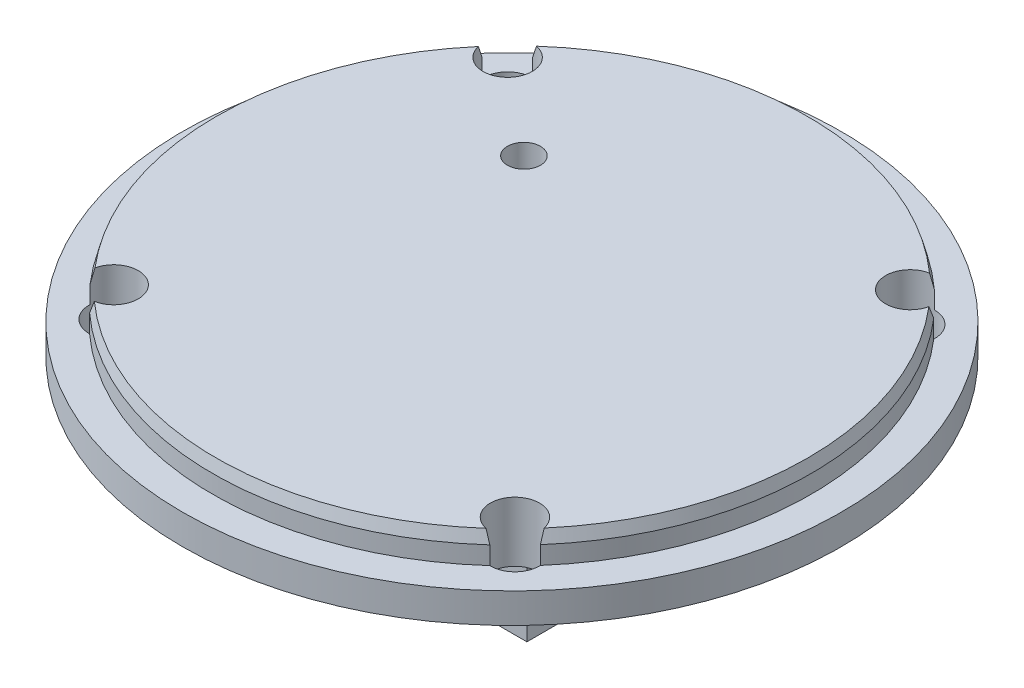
ISO-10303-21;
HEADER;
FILE_DESCRIPTION(('STEP AP214'),'2;1');
FILE_NAME('part.step','',(''),(''),'','','');
FILE_SCHEMA(('AUTOMOTIVE_DESIGN { 1 0 10303 214 1 1 1 1 }'));
ENDSEC;
DATA;
#1=APPLICATION_CONTEXT('core data for automotive mechanical design processes');
#2=APPLICATION_PROTOCOL_DEFINITION('international standard','automotive_design',2000,#1);
#3=PRODUCT_CONTEXT('',#1,'mechanical');
#4=PRODUCT('Part','Part','',(#3));
#5=PRODUCT_RELATED_PRODUCT_CATEGORY('part','',(#4));
#6=PRODUCT_DEFINITION_FORMATION('','',#4);
#7=PRODUCT_DEFINITION_CONTEXT('part definition',#1,'design');
#8=PRODUCT_DEFINITION('design','',#6,#7);
#9=PRODUCT_DEFINITION_SHAPE('','',#8);
#10=(LENGTH_UNIT() NAMED_UNIT(*) SI_UNIT(.MILLI.,.METRE.));
#11=(NAMED_UNIT(*) PLANE_ANGLE_UNIT() SI_UNIT($,.RADIAN.));
#12=(NAMED_UNIT(*) SI_UNIT($,.STERADIAN.) SOLID_ANGLE_UNIT());
#13=UNCERTAINTY_MEASURE_WITH_UNIT(LENGTH_MEASURE(1.E-05),#10,'distance_accuracy_value','');
#14=(GEOMETRIC_REPRESENTATION_CONTEXT(3) GLOBAL_UNCERTAINTY_ASSIGNED_CONTEXT((#13)) GLOBAL_UNIT_ASSIGNED_CONTEXT((#10,
#11,#12)) REPRESENTATION_CONTEXT('',''));
#15=CARTESIAN_POINT('',(0.,0.,0.));
#16=DIRECTION('',(0.,0.,1.));
#17=DIRECTION('',(1.,0.,0.));
#18=AXIS2_PLACEMENT_3D('',#15,#16,#17);
#19=CARTESIAN_POINT('',(0.,10.,0.));
#20=DIRECTION('',(0.,-1.,0.));
#21=DIRECTION('',(0.,0.,-1.));
#22=AXIS2_PLACEMENT_3D('',#19,#20,#21);
#23=CYLINDRICAL_SURFACE('',#22,49.9);
#24=DIRECTION('',(0.,-1.,0.));
#25=VECTOR('',#24,1.);
#26=CARTESIAN_POINT('',(-33.5127812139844,5.,-36.9716580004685));
#27=LINE('',#26,#25);
#28=CARTESIAN_POINT('',(-33.5127812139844,5.,-36.9716580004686));
#29=VERTEX_POINT('',#28);
#30=CARTESIAN_POINT('',(-33.5127812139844,7.99999999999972,-36.9716580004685));
#31=VERTEX_POINT('',#30);
#32=EDGE_CURVE('E236',#29,#31,#27,.F.);
#33=ORIENTED_EDGE('',*,*,#32,.T.);
#34=CARTESIAN_POINT('',(0.,7.99999999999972,0.));
#35=DIRECTION('',(0.,1.,0.));
#36=DIRECTION('',(0.,0.,1.));
#37=AXIS2_PLACEMENT_3D('',#34,#35,#36);
#38=CIRCLE('',#37,49.9);
#39=CARTESIAN_POINT('',(33.5133115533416,7.99999999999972,-36.971177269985));
#40=VERTEX_POINT('',#39);
#41=EDGE_CURVE('E433',#31,#40,#38,.F.);
#42=ORIENTED_EDGE('',*,*,#41,.T.);
#43=DIRECTION('',(0.,-1.,0.));
#44=VECTOR('',#43,1.);
#45=CARTESIAN_POINT('',(33.5133115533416,5.,-36.971177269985));
#46=LINE('',#45,#44);
#47=CARTESIAN_POINT('',(33.5133115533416,5.,-36.9711772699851));
#48=VERTEX_POINT('',#47);
#49=EDGE_CURVE('E242',#40,#48,#46,.T.);
#50=ORIENTED_EDGE('',*,*,#49,.T.);
#51=CARTESIAN_POINT('',(0.,5.,0.));
#52=DIRECTION('',(0.,1.,0.));
#53=DIRECTION('',(0.,0.,1.));
#54=AXIS2_PLACEMENT_3D('',#51,#52,#53);
#55=CIRCLE('',#54,49.9);
#56=EDGE_CURVE('E199',#48,#29,#55,.T.);
#57=ORIENTED_EDGE('',*,*,#56,.T.);
#58=EDGE_LOOP('',(#33,#42,#50,#57));
#59=FACE_BOUND('',#58,.T.);
#60=ADVANCED_FACE('F37',(#59),#23,.T.);
#61=DIRECTION('',(0.,-1.,0.));
#62=VECTOR('',#61,1.);
#63=CARTESIAN_POINT('',(-37.6882981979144,5.,32.7047730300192));
#64=LINE('',#63,#62);
#65=CARTESIAN_POINT('',(-37.6882981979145,5.,32.7047730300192));
#66=VERTEX_POINT('',#65);
#67=CARTESIAN_POINT('',(-37.6882981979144,8.00000000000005,32.7047730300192));
#68=VERTEX_POINT('',#67);
#69=EDGE_CURVE('E217',#66,#68,#64,.F.);
#70=ORIENTED_EDGE('',*,*,#69,.T.);
#71=CARTESIAN_POINT('',(0.,8.00000000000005,0.));
#72=DIRECTION('',(0.,1.,0.));
#73=DIRECTION('',(0.,0.,1.));
#74=AXIS2_PLACEMENT_3D('',#71,#72,#73);
#75=CIRCLE('',#74,49.9);
#76=CARTESIAN_POINT('',(-37.6882981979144,8.00000000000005,-32.7047730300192));
#77=VERTEX_POINT('',#76);
#78=EDGE_CURVE('E376',#68,#77,#75,.F.);
#79=ORIENTED_EDGE('',*,*,#78,.T.);
#80=DIRECTION('',(0.,-1.,0.));
#81=VECTOR('',#80,1.);
#82=CARTESIAN_POINT('',(-37.6882981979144,5.,-32.7047730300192));
#83=LINE('',#82,#81);
#84=CARTESIAN_POINT('',(-37.6882981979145,5.,-32.7047730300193));
#85=VERTEX_POINT('',#84);
#86=EDGE_CURVE('E220',#77,#85,#83,.T.);
#87=ORIENTED_EDGE('',*,*,#86,.T.);
#88=EDGE_CURVE('E200',#85,#66,#55,.T.);
#89=ORIENTED_EDGE('',*,*,#88,.T.);
#90=EDGE_LOOP('',(#70,#79,#87,#89));
#91=FACE_BOUND('',#90,.T.);
#92=ADVANCED_FACE('F216',(#91),#23,.T.);
#93=DIRECTION('',(0.,-1.,0.));
#94=VECTOR('',#93,1.);
#95=CARTESIAN_POINT('',(33.3904623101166,5.,37.0821658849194));
#96=LINE('',#95,#94);
#97=CARTESIAN_POINT('',(33.3904623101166,5.,37.0821658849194));
#98=VERTEX_POINT('',#97);
#99=CARTESIAN_POINT('',(33.3904623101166,8.00000000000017,37.0821658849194));
#100=VERTEX_POINT('',#99);
#101=EDGE_CURVE('E184',#98,#100,#96,.F.);
#102=ORIENTED_EDGE('',*,*,#101,.T.);
#103=CARTESIAN_POINT('',(0.,8.00000000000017,0.));
#104=DIRECTION('',(0.,1.,0.));
#105=DIRECTION('',(0.,0.,1.));
#106=AXIS2_PLACEMENT_3D('',#103,#104,#105);
#107=CIRCLE('',#106,49.9);
#108=CARTESIAN_POINT('',(-33.5127812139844,8.00000000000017,36.9716580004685));
#109=VERTEX_POINT('',#108);
#110=EDGE_CURVE('E11',#100,#109,#107,.F.);
#111=ORIENTED_EDGE('',*,*,#110,.T.);
#112=DIRECTION('',(0.,-1.,0.));
#113=VECTOR('',#112,1.);
#114=CARTESIAN_POINT('',(-33.5127812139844,5.,36.9716580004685));
#115=LINE('',#114,#113);
#116=CARTESIAN_POINT('',(-33.5127812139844,5.,36.9716580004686));
#117=VERTEX_POINT('',#116);
#118=EDGE_CURVE('E228',#109,#117,#115,.T.);
#119=ORIENTED_EDGE('',*,*,#118,.T.);
#120=EDGE_CURVE('E196',#117,#98,#55,.T.);
#121=ORIENTED_EDGE('',*,*,#120,.T.);
#122=EDGE_LOOP('',(#102,#111,#119,#121));
#123=FACE_BOUND('',#122,.T.);
#124=ADVANCED_FACE('F346',(#123),#23,.T.);
#125=CARTESIAN_POINT('',(0.,0.,0.));
#126=DIRECTION('',(0.,1.,0.));
#127=DIRECTION('',(0.,0.,1.));
#128=AXIS2_PLACEMENT_3D('',#125,#126,#127);
#129=PLANE('',#128);
#130=CARTESIAN_POINT('',(-17.9998565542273,0.,-19.9999999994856));
#131=DIRECTION('',(0.,1.,0.));
#132=DIRECTION('',(0.,0.,1.));
#133=AXIS2_PLACEMENT_3D('',#130,#131,#132);
#134=CIRCLE('',#133,2.75);
#135=CARTESIAN_POINT('',(-17.9998565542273,0.,-17.2499999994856));
#136=VERTEX_POINT('',#135);
#137=EDGE_CURVE('E493',#136,#136,#134,.T.);
#138=ORIENTED_EDGE('',*,*,#137,.T.);
#139=EDGE_LOOP('',(#138));
#140=FACE_BOUND('',#139,.T.);
#141=CARTESIAN_POINT('',(-33.5917270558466,0.,-32.8724181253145));
#142=DIRECTION('',(0.,-1.,0.));
#143=DIRECTION('',(0.,0.,-1.));
#144=AXIS2_PLACEMENT_3D('',#141,#142,#143);
#145=CIRCLE('',#144,4.1);
#146=CARTESIAN_POINT('',(-33.5917270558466,0.,-36.9724181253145));
#147=VERTEX_POINT('',#146);
#148=EDGE_CURVE('E487',#147,#147,#145,.T.);
#149=ORIENTED_EDGE('',*,*,#148,.F.);
#150=EDGE_LOOP('',(#149));
#151=FACE_BOUND('',#150,.T.);
#152=CARTESIAN_POINT('',(-33.5917270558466,0.,32.8724181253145));
#153=DIRECTION('',(0.,-1.,0.));
#154=DIRECTION('',(0.,0.,-1.));
#155=AXIS2_PLACEMENT_3D('',#152,#153,#154);
#156=CIRCLE('',#155,4.1);
#157=CARTESIAN_POINT('',(-33.5917270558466,0.,28.7724181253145));
#158=VERTEX_POINT('',#157);
#159=EDGE_CURVE('E490',#158,#158,#156,.T.);
#160=ORIENTED_EDGE('',*,*,#159,.F.);
#161=EDGE_LOOP('',(#160));
#162=FACE_BOUND('',#161,.T.);
#163=CARTESIAN_POINT('',(33.4832151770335,0.,32.9832151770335));
#164=DIRECTION('',(0.,-1.,0.));
#165=DIRECTION('',(0.,0.,-1.));
#166=AXIS2_PLACEMENT_3D('',#163,#164,#165);
#167=CIRCLE('',#166,4.1);
#168=CARTESIAN_POINT('',(33.4832151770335,0.,28.8832151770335));
#169=VERTEX_POINT('',#168);
#170=EDGE_CURVE('E498',#169,#169,#167,.T.);
#171=ORIENTED_EDGE('',*,*,#170,.F.);
#172=EDGE_LOOP('',(#171));
#173=FACE_BOUND('',#172,.T.);
#174=CARTESIAN_POINT('',(33.5921985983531,0.,-32.8719362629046));
#175=DIRECTION('',(0.,-1.,0.));
#176=DIRECTION('',(0.,0.,-1.));
#177=AXIS2_PLACEMENT_3D('',#174,#175,#176);
#178=CIRCLE('',#177,4.1);
#179=CARTESIAN_POINT('',(33.5921985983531,0.,-36.9719362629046));
#180=VERTEX_POINT('',#179);
#181=EDGE_CURVE('E238',#180,#180,#178,.T.);
#182=ORIENTED_EDGE('',*,*,#181,.F.);
#183=EDGE_LOOP('',(#182));
#184=FACE_BOUND('',#183,.T.);
#185=CARTESIAN_POINT('',(0.,0.,0.));
#186=DIRECTION('',(0.,1.,0.));
#187=DIRECTION('',(0.,0.,1.));
#188=AXIS2_PLACEMENT_3D('',#185,#186,#187);
#189=CIRCLE('',#188,55.);
#190=CARTESIAN_POINT('',(0.,0.,55.));
#191=VERTEX_POINT('',#190);
#192=EDGE_CURVE('E206',#191,#191,#189,.T.);
#193=ORIENTED_EDGE('',*,*,#192,.F.);
#194=EDGE_LOOP('',(#193));
#195=FACE_BOUND('',#194,.T.);
#196=DIRECTION('',(0.,0.,-1.));
#197=VECTOR('',#196,1.);
#198=CARTESIAN_POINT('',(-17.5,0.,-15.));
#199=LINE('',#198,#197);
#200=CARTESIAN_POINT('',(-17.5,0.,15.));
#201=VERTEX_POINT('',#200);
#202=CARTESIAN_POINT('',(-17.5,0.,-15.));
#203=VERTEX_POINT('',#202);
#204=EDGE_CURVE('E281',#201,#203,#199,.T.);
#205=ORIENTED_EDGE('',*,*,#204,.F.);
#206=DIRECTION('',(-1.,0.,0.));
#207=VECTOR('',#206,1.);
#208=CARTESIAN_POINT('',(17.5,0.,15.));
#209=LINE('',#208,#207);
#210=CARTESIAN_POINT('',(17.5,0.,15.));
#211=VERTEX_POINT('',#210);
#212=EDGE_CURVE('E286',#211,#201,#209,.T.);
#213=ORIENTED_EDGE('',*,*,#212,.F.);
#214=DIRECTION('',(0.,0.,1.));
#215=VECTOR('',#214,1.);
#216=CARTESIAN_POINT('',(17.5,0.,-15.));
#217=LINE('',#216,#215);
#218=CARTESIAN_POINT('',(17.5,0.,-15.));
#219=VERTEX_POINT('',#218);
#220=EDGE_CURVE('E298',#219,#211,#217,.T.);
#221=ORIENTED_EDGE('',*,*,#220,.F.);
#222=DIRECTION('',(1.,0.,0.));
#223=VECTOR('',#222,1.);
#224=CARTESIAN_POINT('',(17.5,0.,-15.));
#225=LINE('',#224,#223);
#226=EDGE_CURVE('E295',#203,#219,#225,.T.);
#227=ORIENTED_EDGE('',*,*,#226,.F.);
#228=EDGE_LOOP('',(#205,#213,#221,#227));
#229=FACE_BOUND('',#228,.T.);
#230=ADVANCED_FACE('F318',(#140,#151,#162,#173,#184,#195,#229),#129,.F.);
#231=CARTESIAN_POINT('',(0.,5.,0.));
#232=DIRECTION('',(0.,-1.,0.));
#233=DIRECTION('',(0.,0.,-1.));
#234=AXIS2_PLACEMENT_3D('',#231,#232,#233);
#235=CYLINDRICAL_SURFACE('',#234,55.);
#236=CARTESIAN_POINT('',(0.,5.,0.));
#237=DIRECTION('',(0.,1.,0.));
#238=DIRECTION('',(0.,0.,1.));
#239=AXIS2_PLACEMENT_3D('',#236,#237,#238);
#240=CIRCLE('',#239,55.);
#241=CARTESIAN_POINT('',(0.,5.,55.));
#242=VERTEX_POINT('',#241);
#243=EDGE_CURVE('E210',#242,#242,#240,.T.);
#244=ORIENTED_EDGE('',*,*,#243,.F.);
#245=EDGE_LOOP('',(#244));
#246=FACE_BOUND('',#245,.T.);
#247=ORIENTED_EDGE('',*,*,#192,.T.);
#248=EDGE_LOOP('',(#247));
#249=FACE_BOUND('',#248,.T.);
#250=ADVANCED_FACE('F357',(#246,#249),#235,.T.);
#251=CARTESIAN_POINT('',(0.,5.,0.));
#252=DIRECTION('',(0.,1.,0.));
#253=DIRECTION('',(0.,0.,1.));
#254=AXIS2_PLACEMENT_3D('',#251,#252,#253);
#255=PLANE('',#254);
#256=CARTESIAN_POINT('',(-33.5917270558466,5.,-32.8724181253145));
#257=DIRECTION('',(0.,1.,0.));
#258=DIRECTION('',(0.,0.,1.));
#259=AXIS2_PLACEMENT_3D('',#256,#257,#258);
#260=CIRCLE('',#259,4.1);
#261=EDGE_CURVE('E223',#29,#85,#260,.T.);
#262=ORIENTED_EDGE('',*,*,#261,.F.);
#263=ORIENTED_EDGE('',*,*,#56,.F.);
#264=CARTESIAN_POINT('',(33.5921985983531,5.,-32.8719362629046));
#265=DIRECTION('',(0.,1.,0.));
#266=DIRECTION('',(0.,0.,1.));
#267=AXIS2_PLACEMENT_3D('',#264,#265,#266);
#268=CIRCLE('',#267,4.1);
#269=CARTESIAN_POINT('',(37.6887673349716,5.,-32.7042323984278));
#270=VERTEX_POINT('',#269);
#271=EDGE_CURVE('E195',#270,#48,#268,.T.);
#272=ORIENTED_EDGE('',*,*,#271,.F.);
#273=CARTESIAN_POINT('',(37.5803065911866,5.,32.8288068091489));
#274=VERTEX_POINT('',#273);
#275=EDGE_CURVE('E176',#274,#270,#55,.T.);
#276=ORIENTED_EDGE('',*,*,#275,.F.);
#277=CARTESIAN_POINT('',(33.4832151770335,5.,32.9832151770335));
#278=DIRECTION('',(0.,1.,0.));
#279=DIRECTION('',(0.,0.,1.));
#280=AXIS2_PLACEMENT_3D('',#277,#278,#279);
#281=CIRCLE('',#280,4.1);
#282=EDGE_CURVE('E179',#98,#274,#281,.T.);
#283=ORIENTED_EDGE('',*,*,#282,.F.);
#284=ORIENTED_EDGE('',*,*,#120,.F.);
#285=CARTESIAN_POINT('',(-33.5917270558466,5.,32.8724181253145));
#286=DIRECTION('',(0.,1.,0.));
#287=DIRECTION('',(0.,0.,1.));
#288=AXIS2_PLACEMENT_3D('',#285,#286,#287);
#289=CIRCLE('',#288,4.1);
#290=EDGE_CURVE('E225',#66,#117,#289,.T.);
#291=ORIENTED_EDGE('',*,*,#290,.F.);
#292=ORIENTED_EDGE('',*,*,#88,.F.);
#293=EDGE_LOOP('',(#262,#263,#272,#276,#283,#284,#291,#292));
#294=FACE_BOUND('',#293,.T.);
#295=ORIENTED_EDGE('',*,*,#243,.T.);
#296=EDGE_LOOP('',(#295));
#297=FACE_BOUND('',#296,.T.);
#298=ADVANCED_FACE('F191',(#294,#297),#255,.T.);
#299=DIRECTION('',(0.,-1.,0.));
#300=VECTOR('',#299,1.);
#301=CARTESIAN_POINT('',(37.6887673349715,5.,-32.7042323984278));
#302=LINE('',#301,#300);
#303=CARTESIAN_POINT('',(37.6887673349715,7.9999999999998,-32.7042323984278));
#304=VERTEX_POINT('',#303);
#305=EDGE_CURVE('E247',#270,#304,#302,.F.);
#306=ORIENTED_EDGE('',*,*,#305,.T.);
#307=CARTESIAN_POINT('',(0.,7.9999999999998,0.));
#308=DIRECTION('',(0.,1.,0.));
#309=DIRECTION('',(0.,0.,1.));
#310=AXIS2_PLACEMENT_3D('',#307,#308,#309);
#311=CIRCLE('',#310,49.9);
#312=CARTESIAN_POINT('',(37.5803065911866,7.9999999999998,32.8288068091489));
#313=VERTEX_POINT('',#312);
#314=EDGE_CURVE('E61',#304,#313,#311,.F.);
#315=ORIENTED_EDGE('',*,*,#314,.T.);
#316=DIRECTION('',(0.,-1.,0.));
#317=VECTOR('',#316,1.);
#318=CARTESIAN_POINT('',(37.5803065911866,5.,32.8288068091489));
#319=LINE('',#318,#317);
#320=EDGE_CURVE('E172',#313,#274,#319,.T.);
#321=ORIENTED_EDGE('',*,*,#320,.T.);
#322=ORIENTED_EDGE('',*,*,#275,.T.);
#323=EDGE_LOOP('',(#306,#315,#321,#322));
#324=FACE_BOUND('',#323,.T.);
#325=ADVANCED_FACE('F174',(#324),#23,.T.);
#326=CARTESIAN_POINT('',(0.,10.,0.));
#327=DIRECTION('',(0.,1.,0.));
#328=DIRECTION('',(0.,0.,1.));
#329=AXIS2_PLACEMENT_3D('',#326,#327,#328);
#330=PLANE('',#329);
#331=CARTESIAN_POINT('',(-17.9998565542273,10.,-19.9999999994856));
#332=DIRECTION('',(0.,1.,0.));
#333=DIRECTION('',(0.,0.,1.));
#334=AXIS2_PLACEMENT_3D('',#331,#332,#333);
#335=CIRCLE('',#334,2.75);
#336=CARTESIAN_POINT('',(-17.9998565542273,10.,-17.2499999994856));
#337=VERTEX_POINT('',#336);
#338=EDGE_CURVE('E502',#337,#337,#335,.T.);
#339=ORIENTED_EDGE('',*,*,#338,.F.);
#340=EDGE_LOOP('',(#339));
#341=FACE_BOUND('',#340,.T.);
#342=CARTESIAN_POINT('',(-33.5917270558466,10.,-32.8724181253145));
#343=DIRECTION('',(0.,-1.,0.));
#344=DIRECTION('',(0.,0.,-1.));
#345=AXIS2_PLACEMENT_3D('',#342,#343,#344);
#346=CIRCLE('',#345,4.1);
#347=CARTESIAN_POINT('',(-32.7964459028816,10.,-36.8945478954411));
#348=VERTEX_POINT('',#347);
#349=CARTESIAN_POINT('',(-37.5957028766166,10.,-31.9902743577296));
#350=VERTEX_POINT('',#349);
#351=EDGE_CURVE('E180',#348,#350,#346,.T.);
#352=ORIENTED_EDGE('',*,*,#351,.T.);
#353=CARTESIAN_POINT('',(0.,10.,0.));
#354=DIRECTION('',(0.,1.,0.));
#355=DIRECTION('',(0.,0.,1.));
#356=AXIS2_PLACEMENT_3D('',#353,#354,#355);
#357=CIRCLE('',#356,49.3641016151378);
#358=CARTESIAN_POINT('',(-37.5957028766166,10.,31.9902743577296));
#359=VERTEX_POINT('',#358);
#360=EDGE_CURVE('E374',#350,#359,#357,.T.);
#361=ORIENTED_EDGE('',*,*,#360,.T.);
#362=CARTESIAN_POINT('',(-33.5917270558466,10.,32.8724181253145));
#363=DIRECTION('',(0.,1.,0.));
#364=DIRECTION('',(0.,0.,1.));
#365=AXIS2_PLACEMENT_3D('',#362,#363,#364);
#366=CIRCLE('',#365,4.1);
#367=CARTESIAN_POINT('',(-32.7964459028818,10.,36.8945478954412));
#368=VERTEX_POINT('',#367);
#369=EDGE_CURVE('E457',#368,#359,#366,.T.);
#370=ORIENTED_EDGE('',*,*,#369,.F.);
#371=CARTESIAN_POINT('',(0.,10.,0.));
#372=DIRECTION('',(0.,1.,0.));
#373=DIRECTION('',(0.,0.,1.));
#374=AXIS2_PLACEMENT_3D('',#371,#372,#373);
#375=CIRCLE('',#374,49.3641016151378);
#376=CARTESIAN_POINT('',(32.6744293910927,10.,37.0026511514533));
#377=VERTEX_POINT('',#376);
#378=EDGE_CURVE('E370',#368,#377,#375,.T.);
#379=ORIENTED_EDGE('',*,*,#378,.T.);
#380=CARTESIAN_POINT('',(33.4832151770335,10.,32.9832151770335));
#381=DIRECTION('',(0.,1.,0.));
#382=DIRECTION('',(0.,0.,1.));
#383=AXIS2_PLACEMENT_3D('',#380,#381,#382);
#384=CIRCLE('',#383,4.1);
#385=CARTESIAN_POINT('',(37.4900286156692,10.,32.1140511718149));
#386=VERTEX_POINT('',#385);
#387=EDGE_CURVE('E459',#386,#377,#384,.T.);
#388=ORIENTED_EDGE('',*,*,#387,.F.);
#389=CARTESIAN_POINT('',(0.,10.,0.));
#390=DIRECTION('',(0.,1.,0.));
#391=DIRECTION('',(0.,0.,1.));
#392=AXIS2_PLACEMENT_3D('',#389,#390,#391);
#393=CIRCLE('',#392,49.3641016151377);
#394=CARTESIAN_POINT('',(37.5961617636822,10.,-31.9897350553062));
#395=VERTEX_POINT('',#394);
#396=EDGE_CURVE('E452',#386,#395,#393,.T.);
#397=ORIENTED_EDGE('',*,*,#396,.T.);
#398=CARTESIAN_POINT('',(33.5921985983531,10.,-32.8719362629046));
#399=DIRECTION('',(0.,-1.,0.));
#400=DIRECTION('',(0.,0.,-1.));
#401=AXIS2_PLACEMENT_3D('',#398,#399,#400);
#402=CIRCLE('',#401,4.1);
#403=CARTESIAN_POINT('',(32.7969751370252,10.,-36.8940774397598));
#404=VERTEX_POINT('',#403);
#405=EDGE_CURVE('E239',#395,#404,#402,.T.);
#406=ORIENTED_EDGE('',*,*,#405,.T.);
#407=CARTESIAN_POINT('',(0.,10.,0.));
#408=DIRECTION('',(0.,1.,0.));
#409=DIRECTION('',(0.,0.,1.));
#410=AXIS2_PLACEMENT_3D('',#407,#408,#409);
#411=CIRCLE('',#410,49.3641016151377);
#412=EDGE_CURVE('E379',#404,#348,#411,.T.);
#413=ORIENTED_EDGE('',*,*,#412,.T.);
#414=EDGE_LOOP('',(#352,#361,#370,#379,#388,#397,#406,#413));
#415=FACE_BOUND('',#414,.T.);
#416=ADVANCED_FACE('F350',(#341,#415),#330,.T.);
#417=CARTESIAN_POINT('',(-17.5,-25.,-15.));
#418=DIRECTION('',(1.,0.,0.));
#419=DIRECTION('',(0.,0.,-1.));
#420=AXIS2_PLACEMENT_3D('',#417,#418,#419);
#421=PLANE('',#420);
#422=ORIENTED_EDGE('',*,*,#204,.T.);
#423=DIRECTION('',(0.,1.,0.));
#424=VECTOR('',#423,1.);
#425=CARTESIAN_POINT('',(-17.5,-25.,-15.));
#426=LINE('',#425,#424);
#427=CARTESIAN_POINT('',(-17.5,-25.,-15.));
#428=VERTEX_POINT('',#427);
#429=EDGE_CURVE('E197',#428,#203,#426,.T.);
#430=ORIENTED_EDGE('',*,*,#429,.F.);
#431=DIRECTION('',(0.,0.,-1.));
#432=VECTOR('',#431,1.);
#433=CARTESIAN_POINT('',(-17.5,-25.,-15.));
#434=LINE('',#433,#432);
#435=CARTESIAN_POINT('',(-17.5,-25.,15.));
#436=VERTEX_POINT('',#435);
#437=EDGE_CURVE('E282',#436,#428,#434,.T.);
#438=ORIENTED_EDGE('',*,*,#437,.F.);
#439=DIRECTION('',(0.,1.,0.));
#440=VECTOR('',#439,1.);
#441=CARTESIAN_POINT('',(-17.5,-25.,15.));
#442=LINE('',#441,#440);
#443=EDGE_CURVE('E292',#436,#201,#442,.T.);
#444=ORIENTED_EDGE('',*,*,#443,.T.);
#445=EDGE_LOOP('',(#422,#430,#438,#444));
#446=FACE_BOUND('',#445,.T.);
#447=ADVANCED_FACE('F325',(#446),#421,.F.);
#448=CARTESIAN_POINT('',(17.5,-25.,-15.));
#449=DIRECTION('',(0.,0.,1.));
#450=DIRECTION('',(1.,0.,0.));
#451=AXIS2_PLACEMENT_3D('',#448,#449,#450);
#452=PLANE('',#451);
#453=DIRECTION('',(-1.,0.,0.));
#454=VECTOR('',#453,1.);
#455=CARTESIAN_POINT('',(17.5,-7.35,-15.));
#456=LINE('',#455,#454);
#457=CARTESIAN_POINT('',(10.1,-7.35,-15.));
#458=VERTEX_POINT('',#457);
#459=CARTESIAN_POINT('',(-10.1,-7.35,-15.));
#460=VERTEX_POINT('',#459);
#461=EDGE_CURVE('E275',#458,#460,#456,.T.);
#462=ORIENTED_EDGE('',*,*,#461,.T.);
#463=DIRECTION('',(0.,-1.,0.));
#464=VECTOR('',#463,1.);
#465=CARTESIAN_POINT('',(-10.1,-25.,-15.));
#466=LINE('',#465,#464);
#467=CARTESIAN_POINT('',(-10.1,-17.65,-15.));
#468=VERTEX_POINT('',#467);
#469=EDGE_CURVE('E278',#460,#468,#466,.T.);
#470=ORIENTED_EDGE('',*,*,#469,.T.);
#471=DIRECTION('',(1.,0.,0.));
#472=VECTOR('',#471,1.);
#473=CARTESIAN_POINT('',(17.5,-17.65,-15.));
#474=LINE('',#473,#472);
#475=CARTESIAN_POINT('',(10.1,-17.65,-15.));
#476=VERTEX_POINT('',#475);
#477=EDGE_CURVE('E263',#468,#476,#474,.T.);
#478=ORIENTED_EDGE('',*,*,#477,.T.);
#479=DIRECTION('',(0.,1.,0.));
#480=VECTOR('',#479,1.);
#481=CARTESIAN_POINT('',(10.1,-25.,-15.));
#482=LINE('',#481,#480);
#483=EDGE_CURVE('E272',#476,#458,#482,.T.);
#484=ORIENTED_EDGE('',*,*,#483,.T.);
#485=EDGE_LOOP('',(#462,#470,#478,#484));
#486=FACE_BOUND('',#485,.T.);
#487=ORIENTED_EDGE('',*,*,#226,.T.);
#488=DIRECTION('',(0.,1.,0.));
#489=VECTOR('',#488,1.);
#490=CARTESIAN_POINT('',(17.5,-25.,-15.));
#491=LINE('',#490,#489);
#492=CARTESIAN_POINT('',(17.5,-25.,-15.));
#493=VERTEX_POINT('',#492);
#494=EDGE_CURVE('E202',#493,#219,#491,.T.);
#495=ORIENTED_EDGE('',*,*,#494,.F.);
#496=DIRECTION('',(1.,0.,0.));
#497=VECTOR('',#496,1.);
#498=CARTESIAN_POINT('',(17.5,-25.,-15.));
#499=LINE('',#498,#497);
#500=EDGE_CURVE('E285',#428,#493,#499,.T.);
#501=ORIENTED_EDGE('',*,*,#500,.F.);
#502=ORIENTED_EDGE('',*,*,#429,.T.);
#503=EDGE_LOOP('',(#487,#495,#501,#502));
#504=FACE_BOUND('',#503,.T.);
#505=ADVANCED_FACE('F315',(#486,#504),#452,.F.);
#506=CARTESIAN_POINT('',(17.5,-25.,-15.));
#507=DIRECTION('',(-1.,0.,0.));
#508=DIRECTION('',(0.,0.,1.));
#509=AXIS2_PLACEMENT_3D('',#506,#507,#508);
#510=PLANE('',#509);
#511=ORIENTED_EDGE('',*,*,#220,.T.);
#512=DIRECTION('',(0.,1.,0.));
#513=VECTOR('',#512,1.);
#514=CARTESIAN_POINT('',(17.5,-25.,15.));
#515=LINE('',#514,#513);
#516=CARTESIAN_POINT('',(17.5,-25.,15.));
#517=VERTEX_POINT('',#516);
#518=EDGE_CURVE('E305',#517,#211,#515,.T.);
#519=ORIENTED_EDGE('',*,*,#518,.F.);
#520=DIRECTION('',(0.,0.,1.));
#521=VECTOR('',#520,1.);
#522=CARTESIAN_POINT('',(17.5,-25.,-15.));
#523=LINE('',#522,#521);
#524=EDGE_CURVE('E288',#493,#517,#523,.T.);
#525=ORIENTED_EDGE('',*,*,#524,.F.);
#526=ORIENTED_EDGE('',*,*,#494,.T.);
#527=EDGE_LOOP('',(#511,#519,#525,#526));
#528=FACE_BOUND('',#527,.T.);
#529=ADVANCED_FACE('F312',(#528),#510,.F.);
#530=CARTESIAN_POINT('',(17.5,-25.,15.));
#531=DIRECTION('',(0.,0.,-1.));
#532=DIRECTION('',(-1.,0.,0.));
#533=AXIS2_PLACEMENT_3D('',#530,#531,#532);
#534=PLANE('',#533);
#535=DIRECTION('',(1.,0.,0.));
#536=VECTOR('',#535,1.);
#537=CARTESIAN_POINT('',(10.1,-17.65,15.));
#538=LINE('',#537,#536);
#539=CARTESIAN_POINT('',(-10.1,-17.65,15.));
#540=VERTEX_POINT('',#539);
#541=CARTESIAN_POINT('',(10.1,-17.65,15.));
#542=VERTEX_POINT('',#541);
#543=EDGE_CURVE('E251',#540,#542,#538,.T.);
#544=ORIENTED_EDGE('',*,*,#543,.F.);
#545=DIRECTION('',(0.,-1.,0.));
#546=VECTOR('',#545,1.);
#547=CARTESIAN_POINT('',(-10.1,-17.65,15.));
#548=LINE('',#547,#546);
#549=CARTESIAN_POINT('',(-10.1,-7.35,15.));
#550=VERTEX_POINT('',#549);
#551=EDGE_CURVE('E249',#550,#540,#548,.T.);
#552=ORIENTED_EDGE('',*,*,#551,.F.);
#553=DIRECTION('',(-1.,0.,0.));
#554=VECTOR('',#553,1.);
#555=CARTESIAN_POINT('',(10.1,-7.35,15.));
#556=LINE('',#555,#554);
#557=CARTESIAN_POINT('',(10.1,-7.35,15.));
#558=VERTEX_POINT('',#557);
#559=EDGE_CURVE('E257',#558,#550,#556,.T.);
#560=ORIENTED_EDGE('',*,*,#559,.F.);
#561=DIRECTION('',(0.,1.,0.));
#562=VECTOR('',#561,1.);
#563=CARTESIAN_POINT('',(10.1,-17.65,15.));
#564=LINE('',#563,#562);
#565=EDGE_CURVE('E254',#542,#558,#564,.T.);
#566=ORIENTED_EDGE('',*,*,#565,.F.);
#567=EDGE_LOOP('',(#544,#552,#560,#566));
#568=FACE_BOUND('',#567,.T.);
#569=ORIENTED_EDGE('',*,*,#212,.T.);
#570=ORIENTED_EDGE('',*,*,#443,.F.);
#571=DIRECTION('',(-1.,0.,0.));
#572=VECTOR('',#571,1.);
#573=CARTESIAN_POINT('',(17.5,-25.,15.));
#574=LINE('',#573,#572);
#575=EDGE_CURVE('E290',#517,#436,#574,.T.);
#576=ORIENTED_EDGE('',*,*,#575,.F.);
#577=ORIENTED_EDGE('',*,*,#518,.T.);
#578=EDGE_LOOP('',(#569,#570,#576,#577));
#579=FACE_BOUND('',#578,.T.);
#580=ADVANCED_FACE('F321',(#568,#579),#534,.F.);
#581=CARTESIAN_POINT('',(0.,-25.,0.));
#582=DIRECTION('',(0.,-1.,0.));
#583=DIRECTION('',(0.,0.,-1.));
#584=AXIS2_PLACEMENT_3D('',#581,#582,#583);
#585=PLANE('',#584);
#586=ORIENTED_EDGE('',*,*,#437,.T.);
#587=ORIENTED_EDGE('',*,*,#500,.T.);
#588=ORIENTED_EDGE('',*,*,#524,.T.);
#589=ORIENTED_EDGE('',*,*,#575,.T.);
#590=EDGE_LOOP('',(#586,#587,#588,#589));
#591=FACE_BOUND('',#590,.T.);
#592=ADVANCED_FACE('F327',(#591),#585,.T.);
#593=CARTESIAN_POINT('',(-10.1,-17.65,-55.));
#594=DIRECTION('',(-1.,0.,0.));
#595=DIRECTION('',(0.,0.,1.));
#596=AXIS2_PLACEMENT_3D('',#593,#594,#595);
#597=PLANE('',#596);
#598=DIRECTION('',(0.,0.,1.));
#599=VECTOR('',#598,1.);
#600=CARTESIAN_POINT('',(-10.1,-7.35,-55.));
#601=LINE('',#600,#599);
#602=EDGE_CURVE('E261',#460,#550,#601,.T.);
#603=ORIENTED_EDGE('',*,*,#602,.T.);
#604=ORIENTED_EDGE('',*,*,#551,.T.);
#605=DIRECTION('',(0.,0.,1.));
#606=VECTOR('',#605,1.);
#607=CARTESIAN_POINT('',(-10.1,-17.65,-55.));
#608=LINE('',#607,#606);
#609=EDGE_CURVE('E260',#468,#540,#608,.T.);
#610=ORIENTED_EDGE('',*,*,#609,.F.);
#611=ORIENTED_EDGE('',*,*,#469,.F.);
#612=EDGE_LOOP('',(#603,#604,#610,#611));
#613=FACE_BOUND('',#612,.T.);
#614=ADVANCED_FACE('F329',(#613),#597,.F.);
#615=CARTESIAN_POINT('',(10.1,-7.35,-55.));
#616=DIRECTION('',(0.,1.,0.));
#617=DIRECTION('',(-1.,0.,0.));
#618=AXIS2_PLACEMENT_3D('',#615,#616,#617);
#619=PLANE('',#618);
#620=DIRECTION('',(0.,0.,1.));
#621=VECTOR('',#620,1.);
#622=CARTESIAN_POINT('',(10.1,-7.35,-55.));
#623=LINE('',#622,#621);
#624=EDGE_CURVE('E264',#458,#558,#623,.T.);
#625=ORIENTED_EDGE('',*,*,#624,.T.);
#626=ORIENTED_EDGE('',*,*,#559,.T.);
#627=ORIENTED_EDGE('',*,*,#602,.F.);
#628=ORIENTED_EDGE('',*,*,#461,.F.);
#629=EDGE_LOOP('',(#625,#626,#627,#628));
#630=FACE_BOUND('',#629,.T.);
#631=ADVANCED_FACE('F335',(#630),#619,.F.);
#632=CARTESIAN_POINT('',(10.1,-17.65,-55.));
#633=DIRECTION('',(1.,0.,0.));
#634=DIRECTION('',(0.,0.,-1.));
#635=AXIS2_PLACEMENT_3D('',#632,#633,#634);
#636=PLANE('',#635);
#637=DIRECTION('',(0.,0.,1.));
#638=VECTOR('',#637,1.);
#639=CARTESIAN_POINT('',(10.1,-17.65,-55.));
#640=LINE('',#639,#638);
#641=EDGE_CURVE('E266',#476,#542,#640,.T.);
#642=ORIENTED_EDGE('',*,*,#641,.T.);
#643=ORIENTED_EDGE('',*,*,#565,.T.);
#644=ORIENTED_EDGE('',*,*,#624,.F.);
#645=ORIENTED_EDGE('',*,*,#483,.F.);
#646=EDGE_LOOP('',(#642,#643,#644,#645));
#647=FACE_BOUND('',#646,.T.);
#648=ADVANCED_FACE('F528',(#647),#636,.F.);
#649=CARTESIAN_POINT('',(10.1,-17.65,-55.));
#650=DIRECTION('',(0.,-1.,0.));
#651=DIRECTION('',(1.,0.,0.));
#652=AXIS2_PLACEMENT_3D('',#649,#650,#651);
#653=PLANE('',#652);
#654=ORIENTED_EDGE('',*,*,#609,.T.);
#655=ORIENTED_EDGE('',*,*,#543,.T.);
#656=ORIENTED_EDGE('',*,*,#641,.F.);
#657=ORIENTED_EDGE('',*,*,#477,.F.);
#658=EDGE_LOOP('',(#654,#655,#656,#657));
#659=FACE_BOUND('',#658,.T.);
#660=ADVANCED_FACE('F524',(#659),#653,.F.);
#661=CARTESIAN_POINT('',(33.5921985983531,10.,-32.8719362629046));
#662=DIRECTION('',(0.,-1.,0.));
#663=DIRECTION('',(0.,0.,-1.));
#664=AXIS2_PLACEMENT_3D('',#661,#662,#663);
#665=CYLINDRICAL_SURFACE('',#664,4.1);
#666=ORIENTED_EDGE('',*,*,#181,.T.);
#667=EDGE_LOOP('',(#666));
#668=FACE_BOUND('',#667,.T.);
#669=ORIENTED_EDGE('',*,*,#49,.F.);
#670=CARTESIAN_POINT('',(33.5133115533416,7.99999999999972,-36.9711772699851));
#671=CARTESIAN_POINT('',(33.4488291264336,8.16508228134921,-36.9699252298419));
#672=CARTESIAN_POINT('',(33.3856779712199,8.33066409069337,-36.9671990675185));
#673=CARTESIAN_POINT('',(33.2618487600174,8.66261749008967,-36.9590795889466));
#674=CARTESIAN_POINT('',(33.2011698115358,8.82898877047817,-36.9536872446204));
#675=CARTESIAN_POINT('',(33.0820499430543,9.16242940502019,-36.9405152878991));
#676=CARTESIAN_POINT('',(33.0236089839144,9.32949874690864,-36.9327357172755));
#677=CARTESIAN_POINT('',(32.9087834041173,9.66429611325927,-36.9149929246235));
#678=CARTESIAN_POINT('',(32.8523995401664,9.83202435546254,-36.9050289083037));
#679=CARTESIAN_POINT('',(32.7969751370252,10.,-36.8940774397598));
#680=B_SPLINE_CURVE_WITH_KNOTS('',3,(#670,#671,#672,#673,#674,#675,#676,#677,#678,#679),
.UNSPECIFIED.,.F.,.F.,(4,2,2,2,4),(0.,0.531676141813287,1.06315861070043,1.5946317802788,
2.12629852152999),.UNSPECIFIED.);
#681=EDGE_CURVE('E432',#40,#404,#680,.T.);
#682=ORIENTED_EDGE('',*,*,#681,.T.);
#683=ORIENTED_EDGE('',*,*,#405,.F.);
#684=CARTESIAN_POINT('',(37.5961617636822,10.,-31.9897350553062));
#685=CARTESIAN_POINT('',(37.6083117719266,9.83202435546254,-32.0449091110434));
#686=CARTESIAN_POINT('',(37.619495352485,9.66429611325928,-32.1010638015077));
#687=CARTESIAN_POINT('',(37.639722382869,9.32949874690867,-32.2154779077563));
#688=CARTESIAN_POINT('',(37.6487666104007,9.16242940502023,-32.2737365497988));
#689=CARTESIAN_POINT('',(37.66451694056,8.82898877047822,-32.3925429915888));
#690=CARTESIAN_POINT('',(37.671223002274,8.66261749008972,-32.4530908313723));
#691=CARTESIAN_POINT('',(37.6820240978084,8.33066409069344,-32.5767150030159));
#692=CARTESIAN_POINT('',(37.6861181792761,8.16508228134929,-32.6397922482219));
#693=CARTESIAN_POINT('',(37.6887673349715,7.99999999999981,-32.7042323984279));
#694=B_SPLINE_CURVE_WITH_KNOTS('',3,(#684,#685,#686,#687,#688,#689,#690,#691,#692,#693),
.UNSPECIFIED.,.F.,.F.,(4,2,2,2,4),(0.,0.531666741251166,1.06313991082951,1.59462237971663,
2.1262985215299),.UNSPECIFIED.);
#695=EDGE_CURVE('E426',#395,#304,#694,.T.);
#696=ORIENTED_EDGE('',*,*,#695,.T.);
#697=ORIENTED_EDGE('',*,*,#305,.F.);
#698=ORIENTED_EDGE('',*,*,#271,.T.);
#699=EDGE_LOOP('',(#669,#682,#683,#696,#697,#698));
#700=FACE_BOUND('',#699,.T.);
#701=ADVANCED_FACE('F404',(#668,#700),#665,.F.);
#702=CARTESIAN_POINT('',(33.4832151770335,10.,32.9832151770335));
#703=DIRECTION('',(0.,-1.,0.));
#704=DIRECTION('',(0.,0.,-1.));
#705=AXIS2_PLACEMENT_3D('',#702,#703,#704);
#706=CYLINDRICAL_SURFACE('',#705,4.1);
#707=ORIENTED_EDGE('',*,*,#170,.T.);
#708=EDGE_LOOP('',(#707));
#709=FACE_BOUND('',#708,.T.);
#710=ORIENTED_EDGE('',*,*,#320,.F.);
#711=CARTESIAN_POINT('',(37.5803065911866,7.9999999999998,32.8288068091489));
#712=CARTESIAN_POINT('',(37.5778667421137,8.16508272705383,32.764362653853));
#713=CARTESIAN_POINT('',(37.5739777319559,8.33066483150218,32.7012763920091));
#714=CARTESIAN_POINT('',(37.5635788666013,8.66261859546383,32.5776251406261));
#715=CARTESIAN_POINT('',(37.5570699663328,8.8289899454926,32.5170592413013));
#716=CARTESIAN_POINT('',(37.5417067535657,9.16243053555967,32.3982086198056));
#717=CARTESIAN_POINT('',(37.5328524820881,9.32949976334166,32.3399238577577));
#718=CARTESIAN_POINT('',(37.5129987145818,9.6642967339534,32.225450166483));
#719=CARTESIAN_POINT('',(37.5019984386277,9.83202469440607,32.1692620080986));
#720=CARTESIAN_POINT('',(37.4900286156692,9.99999999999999,32.1140511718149));
#721=B_SPLINE_CURVE_WITH_KNOTS('',3,(#711,#712,#713,#714,#715,#716,#717,#718,#719,#720),
.UNSPECIFIED.,.F.,.F.,(4,2,2,2,4),(0.,0.531672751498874,1.0631518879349,1.59462172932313,
2.12628508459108),.UNSPECIFIED.);
#722=EDGE_CURVE('E46',#313,#386,#721,.T.);
#723=ORIENTED_EDGE('',*,*,#722,.T.);
#724=ORIENTED_EDGE('',*,*,#387,.T.);
#725=CARTESIAN_POINT('',(32.6744293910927,10.,37.0026511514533));
#726=CARTESIAN_POINT('',(32.7298140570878,9.83202469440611,37.0137890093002));
#727=CARTESIAN_POINT('',(32.7861613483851,9.66429673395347,37.0239427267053));
#728=CARTESIAN_POINT('',(32.9009207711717,9.32949976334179,37.0420720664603));
#729=CARTESIAN_POINT('',(32.9593321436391,9.16243053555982,37.0500484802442));
#730=CARTESIAN_POINT('',(33.0784004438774,8.82898994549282,37.0636219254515));
#731=CARTESIAN_POINT('',(33.1390574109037,8.66261859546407,37.0692189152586));
#732=CARTESIAN_POINT('',(33.2628511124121,8.33066483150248,37.0777563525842));
#733=CARTESIAN_POINT('',(33.3259887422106,8.16508272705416,37.0806958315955));
#734=CARTESIAN_POINT('',(33.3904623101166,8.00000000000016,37.0821658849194));
#735=B_SPLINE_CURVE_WITH_KNOTS('',3,(#725,#726,#727,#728,#729,#730,#731,#732,#733,#734),
.UNSPECIFIED.,.F.,.F.,(4,2,2,2,4),(0.,0.531663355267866,1.063133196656,1.59461233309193,
2.12628508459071),.UNSPECIFIED.);
#736=EDGE_CURVE('E53',#377,#100,#735,.T.);
#737=ORIENTED_EDGE('',*,*,#736,.T.);
#738=ORIENTED_EDGE('',*,*,#101,.F.);
#739=ORIENTED_EDGE('',*,*,#282,.T.);
#740=EDGE_LOOP('',(#710,#723,#724,#737,#738,#739));
#741=FACE_BOUND('',#740,.T.);
#742=ADVANCED_FACE('F183',(#709,#741),#706,.F.);
#743=CARTESIAN_POINT('',(-33.5917270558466,10.,32.8724181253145));
#744=DIRECTION('',(0.,-1.,0.));
#745=DIRECTION('',(0.,0.,-1.));
#746=AXIS2_PLACEMENT_3D('',#743,#744,#745);
#747=CYLINDRICAL_SURFACE('',#746,4.1);
#748=ORIENTED_EDGE('',*,*,#159,.T.);
#749=EDGE_LOOP('',(#748));
#750=FACE_BOUND('',#749,.T.);
#751=ORIENTED_EDGE('',*,*,#369,.T.);
#752=CARTESIAN_POINT('',(-37.5957028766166,10.,31.9902743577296));
#753=CARTESIAN_POINT('',(-37.6078520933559,9.83202435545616,32.045448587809));
#754=CARTESIAN_POINT('',(-37.61903486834,9.66429611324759,32.1016034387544));
#755=CARTESIAN_POINT('',(-37.6392602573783,9.32949874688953,32.2160178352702));
#756=CARTESIAN_POINT('',(-37.6483036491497,9.16242940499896,32.2742766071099));
#757=CARTESIAN_POINT('',(-37.6640522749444,8.82898877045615,32.3930832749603));
#758=CARTESIAN_POINT('',(-37.6707574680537,8.66261749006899,32.4536312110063));
#759=CARTESIAN_POINT('',(-37.6815567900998,8.33066409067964,32.5772555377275));
#760=CARTESIAN_POINT('',(-37.685649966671,8.16508228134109,32.6403328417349));
#761=CARTESIAN_POINT('',(-37.6882981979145,8.00000000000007,32.7047730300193));
#762=B_SPLINE_CURVE_WITH_KNOTS('',3,(#752,#753,#754,#755,#756,#757,#758,#759,#760,#761),
.UNSPECIFIED.,.F.,.F.,(4,2,2,2,4),(0.,0.53166674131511,1.06313991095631,1.59462237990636,
2.12629852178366),.UNSPECIFIED.);
#763=EDGE_CURVE('E373',#359,#68,#762,.T.);
#764=ORIENTED_EDGE('',*,*,#763,.T.);
#765=ORIENTED_EDGE('',*,*,#69,.F.);
#766=ORIENTED_EDGE('',*,*,#290,.T.);
#767=ORIENTED_EDGE('',*,*,#118,.F.);
#768=CARTESIAN_POINT('',(-33.5127812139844,8.00000000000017,36.9716580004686));
#769=CARTESIAN_POINT('',(-33.448298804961,8.16508228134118,36.9704050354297));
#770=CARTESIAN_POINT('',(-33.3851476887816,8.33066409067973,36.9676779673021));
#771=CARTESIAN_POINT('',(-33.2613185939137,8.66261749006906,36.9595567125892));
#772=CARTESIAN_POINT('',(-33.2006397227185,8.82898877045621,36.9541634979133));
#773=CARTESIAN_POINT('',(-33.0815200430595,9.162429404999,36.9409898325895));
#774=CARTESIAN_POINT('',(-33.0230791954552,9.32949874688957,36.9332094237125));
#775=CARTESIAN_POINT('',(-32.9082538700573,9.66429611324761,36.9154649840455));
#776=CARTESIAN_POINT('',(-32.8518701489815,9.83202435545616,36.905500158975));
#777=CARTESIAN_POINT('',(-32.7964459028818,10.,36.8945478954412));
#778=B_SPLINE_CURVE_WITH_KNOTS('',3,(#768,#769,#770,#771,#772,#773,#774,#775,#776,#777),
.UNSPECIFIED.,.F.,.F.,(4,2,2,2,4),(0.,0.53167614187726,1.06315861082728,1.59463178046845,
2.12629852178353),.UNSPECIFIED.);
#779=EDGE_CURVE('E369',#109,#368,#778,.T.);
#780=ORIENTED_EDGE('',*,*,#779,.T.);
#781=EDGE_LOOP('',(#751,#764,#765,#766,#767,#780));
#782=FACE_BOUND('',#781,.T.);
#783=ADVANCED_FACE('F391',(#750,#782),#747,.F.);
#784=CARTESIAN_POINT('',(-33.5917270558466,10.,-32.8724181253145));
#785=DIRECTION('',(0.,-1.,0.));
#786=DIRECTION('',(0.,0.,-1.));
#787=AXIS2_PLACEMENT_3D('',#784,#785,#786);
#788=CYLINDRICAL_SURFACE('',#787,4.1);
#789=ORIENTED_EDGE('',*,*,#148,.T.);
#790=EDGE_LOOP('',(#789));
#791=FACE_BOUND('',#790,.T.);
#792=ORIENTED_EDGE('',*,*,#86,.F.);
#793=CARTESIAN_POINT('',(-37.6882981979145,8.00000000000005,-32.7047730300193));
#794=CARTESIAN_POINT('',(-37.685649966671,8.16508228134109,-32.6403328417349));
#795=CARTESIAN_POINT('',(-37.6815567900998,8.33066409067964,-32.5772555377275));
#796=CARTESIAN_POINT('',(-37.6707574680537,8.66261749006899,-32.4536312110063));
#797=CARTESIAN_POINT('',(-37.6640522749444,8.82898877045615,-32.3930832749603));
#798=CARTESIAN_POINT('',(-37.6483036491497,9.16242940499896,-32.27427660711));
#799=CARTESIAN_POINT('',(-37.6392602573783,9.32949874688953,-32.2160178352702));
#800=CARTESIAN_POINT('',(-37.61903486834,9.66429611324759,-32.1016034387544));
#801=CARTESIAN_POINT('',(-37.6078520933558,9.83202435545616,-32.0454485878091));
#802=CARTESIAN_POINT('',(-37.5957028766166,10.,-31.9902743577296));
#803=B_SPLINE_CURVE_WITH_KNOTS('',3,(#793,#794,#795,#796,#797,#798,#799,#800,#801,#802),
.UNSPECIFIED.,.F.,.F.,(4,2,2,2,4),(0.,0.531676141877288,1.06315861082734,1.59463178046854,
2.12629852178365),.UNSPECIFIED.);
#804=EDGE_CURVE('E476',#77,#350,#803,.T.);
#805=ORIENTED_EDGE('',*,*,#804,.T.);
#806=ORIENTED_EDGE('',*,*,#351,.F.);
#807=CARTESIAN_POINT('',(-32.7964459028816,10.,-36.8945478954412));
#808=CARTESIAN_POINT('',(-32.8518701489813,9.83202435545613,-36.905500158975));
#809=CARTESIAN_POINT('',(-32.9082538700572,9.66429611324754,-36.9154649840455));
#810=CARTESIAN_POINT('',(-33.0230791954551,9.32949874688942,-36.9332094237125));
#811=CARTESIAN_POINT('',(-33.0815200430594,9.16242940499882,-36.9409898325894));
#812=CARTESIAN_POINT('',(-33.2006397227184,8.82898877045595,-36.9541634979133));
#813=CARTESIAN_POINT('',(-33.2613185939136,8.66261749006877,-36.9595567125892));
#814=CARTESIAN_POINT('',(-33.3851476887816,8.33066409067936,-36.9676779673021));
#815=CARTESIAN_POINT('',(-33.448298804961,8.16508228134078,-36.9704050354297));
#816=CARTESIAN_POINT('',(-33.5127812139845,7.99999999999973,-36.9716580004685));
#817=B_SPLINE_CURVE_WITH_KNOTS('',3,(#807,#808,#809,#810,#811,#812,#813,#814,#815,#816),
.UNSPECIFIED.,.F.,.F.,(4,2,2,2,4),(0.,0.531666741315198,1.06313991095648,1.59462237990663,
2.12629852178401),.UNSPECIFIED.);
#818=EDGE_CURVE('E453',#348,#31,#817,.T.);
#819=ORIENTED_EDGE('',*,*,#818,.T.);
#820=ORIENTED_EDGE('',*,*,#32,.F.);
#821=ORIENTED_EDGE('',*,*,#261,.T.);
#822=EDGE_LOOP('',(#792,#805,#806,#819,#820,#821));
#823=FACE_BOUND('',#822,.T.);
#824=ADVANCED_FACE('F396',(#791,#823),#788,.F.);
#825=CARTESIAN_POINT('',(-17.9998565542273,-25.,-19.9999999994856));
#826=DIRECTION('',(0.,1.,0.));
#827=DIRECTION('',(0.,0.,1.));
#828=AXIS2_PLACEMENT_3D('',#825,#826,#827);
#829=CYLINDRICAL_SURFACE('',#828,2.75);
#830=ORIENTED_EDGE('',*,*,#338,.T.);
#831=EDGE_LOOP('',(#830));
#832=FACE_BOUND('',#831,.T.);
#833=ORIENTED_EDGE('',*,*,#137,.F.);
#834=EDGE_LOOP('',(#833));
#835=FACE_BOUND('',#834,.T.);
#836=ADVANCED_FACE('F473',(#832,#835),#829,.F.);
#837=CARTESIAN_POINT('',(0.,10.,0.));
#838=DIRECTION('',(0.,-1.,0.));
#839=DIRECTION('',(0.,0.,-1.));
#840=AXIS2_PLACEMENT_3D('',#837,#838,#839);
#841=CONICAL_SURFACE('',#840,49.3641016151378,0.261799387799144);
#842=ORIENTED_EDGE('',*,*,#804,.F.);
#843=ORIENTED_EDGE('',*,*,#78,.F.);
#844=ORIENTED_EDGE('',*,*,#763,.F.);
#845=ORIENTED_EDGE('',*,*,#360,.F.);
#846=EDGE_LOOP('',(#842,#843,#844,#845));
#847=FACE_BOUND('',#846,.T.);
#848=ADVANCED_FACE('F470',(#847),#841,.T.);
#849=CARTESIAN_POINT('',(0.,10.,0.));
#850=DIRECTION('',(0.,-1.,0.));
#851=DIRECTION('',(0.,0.,-1.));
#852=AXIS2_PLACEMENT_3D('',#849,#850,#851);
#853=CONICAL_SURFACE('',#852,49.3641016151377,0.261799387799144);
#854=ORIENTED_EDGE('',*,*,#681,.F.);
#855=ORIENTED_EDGE('',*,*,#41,.F.);
#856=ORIENTED_EDGE('',*,*,#818,.F.);
#857=ORIENTED_EDGE('',*,*,#412,.F.);
#858=EDGE_LOOP('',(#854,#855,#856,#857));
#859=FACE_BOUND('',#858,.T.);
#860=ADVANCED_FACE('F421',(#859),#853,.T.);
#861=CARTESIAN_POINT('',(0.,10.,0.));
#862=DIRECTION('',(0.,-1.,0.));
#863=DIRECTION('',(0.,0.,-1.));
#864=AXIS2_PLACEMENT_3D('',#861,#862,#863);
#865=CONICAL_SURFACE('',#864,49.3641016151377,0.261799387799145);
#866=ORIENTED_EDGE('',*,*,#722,.F.);
#867=ORIENTED_EDGE('',*,*,#314,.F.);
#868=ORIENTED_EDGE('',*,*,#695,.F.);
#869=ORIENTED_EDGE('',*,*,#396,.F.);
#870=EDGE_LOOP('',(#866,#867,#868,#869));
#871=FACE_BOUND('',#870,.T.);
#872=ADVANCED_FACE('F417',(#871),#865,.T.);
#873=CARTESIAN_POINT('',(0.,10.,0.));
#874=DIRECTION('',(0.,-1.,0.));
#875=DIRECTION('',(0.,0.,-1.));
#876=AXIS2_PLACEMENT_3D('',#873,#874,#875);
#877=CONICAL_SURFACE('',#876,49.3641016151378,0.261799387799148);
#878=ORIENTED_EDGE('',*,*,#779,.F.);
#879=ORIENTED_EDGE('',*,*,#110,.F.);
#880=ORIENTED_EDGE('',*,*,#736,.F.);
#881=ORIENTED_EDGE('',*,*,#378,.F.);
#882=EDGE_LOOP('',(#878,#879,#880,#881));
#883=FACE_BOUND('',#882,.T.);
#884=ADVANCED_FACE('F39',(#883),#877,.T.);
#885=CLOSED_SHELL('',(#60,#92,#124,#230,#250,#298,#325,#416,#447,#505,#529,#580,#592,#614,#631,
#648,#660,#701,#742,#783,#824,#836,#848,#860,#872,#884));
#886=MANIFOLD_SOLID_BREP('B2',#885);
#887=ADVANCED_BREP_SHAPE_REPRESENTATION('',(#18,#886),#14);
#888=SHAPE_DEFINITION_REPRESENTATION(#9,#887);
ENDSEC;
END-ISO-10303-21;
